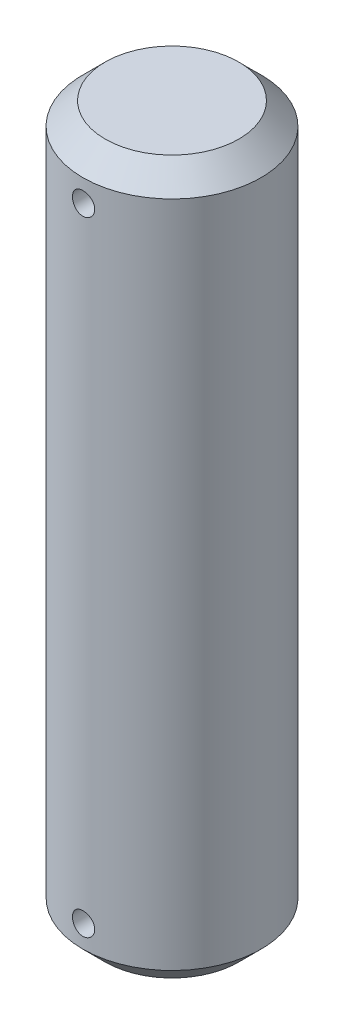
ISO-10303-21;
HEADER;
FILE_DESCRIPTION(('STEP AP214'),'2;1');
FILE_NAME('part.step','',(''),(''),'','','');
FILE_SCHEMA(('AUTOMOTIVE_DESIGN { 1 0 10303 214 1 1 1 1 }'));
ENDSEC;
DATA;
#1=APPLICATION_CONTEXT('core data for automotive mechanical design processes');
#2=APPLICATION_PROTOCOL_DEFINITION('international standard','automotive_design',2000,#1);
#3=PRODUCT_CONTEXT('',#1,'mechanical');
#4=PRODUCT('Part','Part','',(#3));
#5=PRODUCT_RELATED_PRODUCT_CATEGORY('part','',(#4));
#6=PRODUCT_DEFINITION_FORMATION('','',#4);
#7=PRODUCT_DEFINITION_CONTEXT('part definition',#1,'design');
#8=PRODUCT_DEFINITION('design','',#6,#7);
#9=PRODUCT_DEFINITION_SHAPE('','',#8);
#10=(LENGTH_UNIT() NAMED_UNIT(*) SI_UNIT(.MILLI.,.METRE.));
#11=(NAMED_UNIT(*) PLANE_ANGLE_UNIT() SI_UNIT($,.RADIAN.));
#12=(NAMED_UNIT(*) SI_UNIT($,.STERADIAN.) SOLID_ANGLE_UNIT());
#13=UNCERTAINTY_MEASURE_WITH_UNIT(LENGTH_MEASURE(1.E-05),#10,'distance_accuracy_value','');
#14=(GEOMETRIC_REPRESENTATION_CONTEXT(3) GLOBAL_UNCERTAINTY_ASSIGNED_CONTEXT((#13)) GLOBAL_UNIT_ASSIGNED_CONTEXT((#10,
#11,#12)) REPRESENTATION_CONTEXT('',''));
#15=CARTESIAN_POINT('',(0.,0.,0.));
#16=DIRECTION('',(0.,0.,1.));
#17=DIRECTION('',(1.,0.,0.));
#18=AXIS2_PLACEMENT_3D('',#15,#16,#17);
#19=CARTESIAN_POINT('',(0.,50.8,0.));
#20=DIRECTION('',(0.,-1.,0.));
#21=DIRECTION('',(0.,0.,-1.));
#22=AXIS2_PLACEMENT_3D('',#19,#20,#21);
#23=CYLINDRICAL_SURFACE('',#22,12.7);
#24=CARTESIAN_POINT('',(0.,-42.8625,-12.7));
#25=CARTESIAN_POINT('',(-0.0887990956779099,-42.8625037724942,-12.6999987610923));
#26=CARTESIAN_POINT('',(-0.177653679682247,-42.8699757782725,-12.6990588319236));
#27=CARTESIAN_POINT('',(-0.352890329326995,-42.8996651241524,-12.6953996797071));
#28=CARTESIAN_POINT('',(-0.439269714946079,-42.9218978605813,-12.6926785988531));
#29=CARTESIAN_POINT('',(-0.606993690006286,-42.9804434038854,-12.685763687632));
#30=CARTESIAN_POINT('',(-0.688341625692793,-43.0167467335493,-12.6815708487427));
#31=CARTESIAN_POINT('',(-0.843774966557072,-43.1023822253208,-12.6721787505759));
#32=CARTESIAN_POINT('',(-0.917861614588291,-43.151712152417,-12.6669796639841));
#33=CARTESIAN_POINT('',(-1.05709263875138,-43.2622908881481,-12.6561235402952));
#34=CARTESIAN_POINT('',(-1.12219128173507,-43.3235970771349,-12.6504643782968));
#35=CARTESIAN_POINT('',(-1.241204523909,-43.4562648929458,-12.6393430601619));
#36=CARTESIAN_POINT('',(-1.29511855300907,-43.5276270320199,-12.6338809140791));
#37=CARTESIAN_POINT('',(-1.39040245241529,-43.6786781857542,-12.6237511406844));
#38=CARTESIAN_POINT('',(-1.43172948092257,-43.7583944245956,-12.6190862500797));
#39=CARTESIAN_POINT('',(-1.50039265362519,-43.9237037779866,-12.6111071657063));
#40=CARTESIAN_POINT('',(-1.52772932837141,-44.0092966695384,-12.6077929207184));
#41=CARTESIAN_POINT('',(-1.56749685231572,-44.1834550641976,-12.6029106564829));
#42=CARTESIAN_POINT('',(-1.58000491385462,-44.2720026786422,-12.6013335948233));
#43=CARTESIAN_POINT('',(-1.58999907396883,-44.4499531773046,-12.6000765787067));
#44=CARTESIAN_POINT('',(-1.58748577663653,-44.5393560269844,-12.6003965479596));
#45=CARTESIAN_POINT('',(-1.56757194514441,-44.715941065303,-12.6028891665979));
#46=CARTESIAN_POINT('',(-1.55025646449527,-44.8031330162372,-12.6050512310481));
#47=CARTESIAN_POINT('',(-1.50136249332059,-44.9733638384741,-12.6109679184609));
#48=CARTESIAN_POINT('',(-1.46978371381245,-45.0564026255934,-12.6147225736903));
#49=CARTESIAN_POINT('',(-1.39316813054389,-45.2162341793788,-12.6234133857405));
#50=CARTESIAN_POINT('',(-1.34809436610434,-45.2930090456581,-12.6283527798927));
#51=CARTESIAN_POINT('',(-1.24579473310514,-45.4379372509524,-12.6388540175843));
#52=CARTESIAN_POINT('',(-1.18856830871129,-45.5060901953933,-12.644415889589));
#53=CARTESIAN_POINT('',(-1.06311643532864,-45.6323336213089,-12.6555824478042));
#54=CARTESIAN_POINT('',(-0.994817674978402,-45.6903512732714,-12.6611871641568));
#55=CARTESIAN_POINT('',(-0.849412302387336,-45.7941101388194,-12.6717719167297));
#56=CARTESIAN_POINT('',(-0.772305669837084,-45.8398513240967,-12.6767519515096));
#57=CARTESIAN_POINT('',(-0.611417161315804,-45.9177588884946,-12.685529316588));
#58=CARTESIAN_POINT('',(-0.527633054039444,-45.9499207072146,-12.6893262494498));
#59=CARTESIAN_POINT('',(-0.355795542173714,-45.9996987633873,-12.6953059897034));
#60=CARTESIAN_POINT('',(-0.267742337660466,-46.017315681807,-12.6974888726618));
#61=CARTESIAN_POINT('',(-0.0904958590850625,-46.0374094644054,-12.6999847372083));
#62=CARTESIAN_POINT('',(-0.00131412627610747,-46.0399866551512,-12.7003101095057));
#63=CARTESIAN_POINT('',(0.176209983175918,-46.0301925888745,-12.6990877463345));
#64=CARTESIAN_POINT('',(0.264552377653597,-46.0178216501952,-12.6975400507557));
#65=CARTESIAN_POINT('',(0.437594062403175,-45.9785658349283,-12.692753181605));
#66=CARTESIAN_POINT('',(0.522304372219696,-45.9517287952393,-12.6895195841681));
#67=CARTESIAN_POINT('',(0.686022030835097,-45.8843523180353,-12.6817229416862));
#68=CARTESIAN_POINT('',(0.765029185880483,-45.8438124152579,-12.677159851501));
#69=CARTESIAN_POINT('',(0.915545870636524,-45.7499382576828,-12.6671820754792));
#70=CARTESIAN_POINT('',(0.987014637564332,-45.6965391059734,-12.6617631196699));
#71=CARTESIAN_POINT('',(1.12001108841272,-45.5785540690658,-12.6506931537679));
#72=CARTESIAN_POINT('',(1.18153837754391,-45.5139677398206,-12.6450421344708));
#73=CARTESIAN_POINT('',(1.29326129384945,-45.3749997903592,-12.6341067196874));
#74=CARTESIAN_POINT('',(1.34339041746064,-45.3005645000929,-12.6288245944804));
#75=CARTESIAN_POINT('',(1.43043458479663,-45.1442720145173,-12.6192623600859));
#76=CARTESIAN_POINT('',(1.46734989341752,-45.0624149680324,-12.614982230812));
#77=CARTESIAN_POINT('',(1.52681087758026,-44.8938171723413,-12.6079240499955));
#78=CARTESIAN_POINT('',(1.54939404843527,-44.8070898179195,-12.6051420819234));
#79=CARTESIAN_POINT('',(1.57967044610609,-44.6310369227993,-12.6013839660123));
#80=CARTESIAN_POINT('',(1.58736436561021,-44.541711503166,-12.6004077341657));
#81=CARTESIAN_POINT('',(1.58763115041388,-44.363659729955,-12.6003740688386));
#82=CARTESIAN_POINT('',(1.58030849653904,-44.2749335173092,-12.6013033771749));
#83=CARTESIAN_POINT('',(1.55097124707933,-44.0999834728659,-12.6049475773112));
#84=CARTESIAN_POINT('',(1.52895664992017,-44.0137596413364,-12.6076624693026));
#85=CARTESIAN_POINT('',(1.47089309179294,-43.8462756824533,-12.6145678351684));
#86=CARTESIAN_POINT('',(1.43484916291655,-43.7650137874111,-12.6187577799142));
#87=CARTESIAN_POINT('',(1.34976038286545,-43.6096748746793,-12.6281420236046));
#88=CARTESIAN_POINT('',(1.30071536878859,-43.5355979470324,-12.6333363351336));
#89=CARTESIAN_POINT('',(1.19062902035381,-43.3961976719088,-12.6441873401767));
#90=CARTESIAN_POINT('',(1.1295098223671,-43.3309360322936,-12.6498468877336));
#91=CARTESIAN_POINT('',(0.997172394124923,-43.2115551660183,-12.6609654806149));
#92=CARTESIAN_POINT('',(0.925951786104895,-43.1574385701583,-12.66642447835));
#93=CARTESIAN_POINT('',(0.775122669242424,-43.0617087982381,-12.6765498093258));
#94=CARTESIAN_POINT('',(0.695483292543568,-43.020143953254,-12.6812130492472));
#95=CARTESIAN_POINT('',(0.530341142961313,-42.9510372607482,-12.6891900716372));
#96=CARTESIAN_POINT('',(0.4448448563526,-42.9234801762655,-12.6925053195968));
#97=CARTESIAN_POINT('',(0.299088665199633,-42.8897673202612,-12.6966136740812));
#98=CARTESIAN_POINT('',(0.239747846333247,-42.8795567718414,-12.6978773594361));
#99=CARTESIAN_POINT('',(0.120279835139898,-42.8659218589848,-12.6995709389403));
#100=CARTESIAN_POINT('',(0.0601526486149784,-42.8624974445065,-12.700000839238));
#101=CARTESIAN_POINT('',(0.,-42.8625,-12.7));
#102=B_SPLINE_CURVE_WITH_KNOTS('',3,(#24,#25,#26,#27,#28,#29,#30,#31,#32,#33,#34,#35,#36,#37,
#38,#39,#40,#41,#42,#43,#44,#45,#46,#47,#48,#49,#50,#51,#52,#53,#54,#55,#56,#57,#58,#59,#60,#61,
#62,#63,#64,#65,#66,#67,#68,#69,#70,#71,#72,#73,#74,#75,#76,#77,#78,#79,#80,#81,#82,#83,#84,#85,
#86,#87,#88,#89,#90,#91,#92,#93,#94,#95,#96,#97,#98,#99,#100,#101),.UNSPECIFIED.,.T.,.F.,(4,2,2,
2,2,2,2,2,2,2,2,2,2,2,2,2,2,2,2,2,2,2,2,2,2,2,2,2,2,2,2,2,2,2,2,2,2,2,4),(0.,0.266177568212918,
0.532633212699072,0.798909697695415,1.06514052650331,1.3326796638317,1.60023243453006,
1.86868593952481,2.13712926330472,2.40416858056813,2.67119715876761,2.93670162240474,
3.20221146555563,3.46845525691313,3.73471122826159,4.00280808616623,4.27090556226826,
4.53909300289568,4.807267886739,5.07365177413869,5.34002998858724,5.60553269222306,
5.87104441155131,6.13792525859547,6.4048167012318,6.67322751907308,6.94163295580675,
7.20933327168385,7.47702113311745,7.74285282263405,8.00868454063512,8.27442099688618,
8.54016078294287,8.80767375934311,9.07524981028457,9.34384340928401,9.6121442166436,
9.79245465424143,9.97276376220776),.UNSPECIFIED.);
#103=CARTESIAN_POINT('',(0.,-42.8625,-12.7));
#104=VERTEX_POINT('',#103);
#105=EDGE_CURVE('E35',#104,#104,#102,.T.);
#106=ORIENTED_EDGE('',*,*,#105,.T.);
#107=EDGE_LOOP('',(#106));
#108=FACE_BOUND('',#107,.T.);
#109=CARTESIAN_POINT('',(1.5875,-44.45,12.6003906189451));
#110=CARTESIAN_POINT('',(1.58749622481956,-44.5387960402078,12.6003918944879));
#111=CARTESIAN_POINT('',(1.58002471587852,-44.6276475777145,12.6013393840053));
#112=CARTESIAN_POINT('',(1.55033752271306,-44.8028778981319,12.6050255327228));
#113=CARTESIAN_POINT('',(1.52810643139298,-44.8892539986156,12.6077660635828));
#114=CARTESIAN_POINT('',(1.46956569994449,-45.0569710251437,12.614723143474));
#115=CARTESIAN_POINT('',(1.43326561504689,-45.1383153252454,12.6189386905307));
#116=CARTESIAN_POINT('',(1.34763776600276,-45.2937425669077,12.6283696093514));
#117=CARTESIAN_POINT('',(1.298312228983,-45.3678267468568,12.6335848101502));
#118=CARTESIAN_POINT('',(1.18773794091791,-45.5070605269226,12.6444601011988));
#119=CARTESIAN_POINT('',(1.12643082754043,-45.5721636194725,12.650122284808));
#120=CARTESIAN_POINT('',(0.993759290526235,-45.6911854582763,12.6612347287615));
#121=CARTESIAN_POINT('',(0.922394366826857,-45.7451036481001,12.6666849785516));
#122=CARTESIAN_POINT('',(0.771340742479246,-45.8403919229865,12.6767808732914));
#123=CARTESIAN_POINT('',(0.691625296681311,-45.8817199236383,12.6814237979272));
#124=CARTESIAN_POINT('',(0.52631766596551,-45.9503851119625,12.6893589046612));
#125=CARTESIAN_POINT('',(0.440725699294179,-45.9777228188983,12.6926511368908));
#126=CARTESIAN_POINT('',(0.266570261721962,-46.0174924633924,12.6974991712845));
#127=CARTESIAN_POINT('',(0.17802470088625,-46.0300017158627,12.6990639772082));
#128=CARTESIAN_POINT('',(7.82324359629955E-05,-46.0399989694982,12.7003115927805));
#129=CARTESIAN_POINT('',(-0.0893226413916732,-46.0374875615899,12.6999944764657));
#130=CARTESIAN_POINT('',(-0.26591594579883,-46.017576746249,12.6975212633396));
#131=CARTESIAN_POINT('',(-0.353117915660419,-46.0002604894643,12.6953754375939));
#132=CARTESIAN_POINT('',(-0.523368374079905,-45.95136150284,12.6894974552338));
#133=CARTESIAN_POINT('',(-0.606416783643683,-45.9197785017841,12.6857652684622));
#134=CARTESIAN_POINT('',(-0.766260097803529,-45.8431541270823,12.6771162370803));
#135=CARTESIAN_POINT('',(-0.843037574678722,-45.7980767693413,12.6721962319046));
#136=CARTESIAN_POINT('',(-0.987969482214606,-45.6957694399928,12.6617220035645));
#137=CARTESIAN_POINT('',(-1.05612351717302,-45.6385389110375,12.6561677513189));
#138=CARTESIAN_POINT('',(-1.18236239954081,-45.51308409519,12.6450018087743));
#139=CARTESIAN_POINT('',(-1.24037524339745,-45.4447873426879,12.63938998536));
#140=CARTESIAN_POINT('',(-1.34412536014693,-45.2993877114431,12.6287788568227));
#141=CARTESIAN_POINT('',(-1.38986259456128,-45.2222848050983,12.6237795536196));
#142=CARTESIAN_POINT('',(-1.46776730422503,-45.0613973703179,12.6149595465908));
#143=CARTESIAN_POINT('',(-1.49992901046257,-44.9776100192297,12.6111393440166));
#144=CARTESIAN_POINT('',(-1.54970585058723,-44.8057654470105,12.6051198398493));
#145=CARTESIAN_POINT('',(-1.56732168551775,-44.717708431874,12.6029204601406));
#146=CARTESIAN_POINT('',(-1.58741137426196,-44.5404600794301,12.6004058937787));
#147=CARTESIAN_POINT('',(-1.58998655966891,-44.4512803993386,12.6000780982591));
#148=CARTESIAN_POINT('',(-1.5801892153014,-44.2737608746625,12.6013104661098));
#149=CARTESIAN_POINT('',(-1.56781700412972,-44.1854210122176,12.6028705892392));
#150=CARTESIAN_POINT('',(-1.52856138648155,-44.0123924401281,12.6076915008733));
#151=CARTESIAN_POINT('',(-1.50172704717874,-43.9276924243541,12.6109465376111));
#152=CARTESIAN_POINT('',(-1.43435941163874,-43.7639941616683,12.6187858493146));
#153=CARTESIAN_POINT('',(-1.39382563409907,-43.684996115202,12.6233701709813));
#154=CARTESIAN_POINT('',(-1.29996058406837,-43.5344858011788,12.633381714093));
#155=CARTESIAN_POINT('',(-1.24656286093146,-43.4630152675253,12.6388132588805));
#156=CARTESIAN_POINT('',(-1.12857962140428,-43.3300145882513,12.649893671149));
#157=CARTESIAN_POINT('',(-1.06399366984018,-43.2684848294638,12.6555425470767));
#158=CARTESIAN_POINT('',(-0.925024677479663,-43.1567563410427,12.6664598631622));
#159=CARTESIAN_POINT('',(-0.850587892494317,-43.1066241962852,12.6717259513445));
#160=CARTESIAN_POINT('',(-0.694291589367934,-43.0195747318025,12.6812491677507));
#161=CARTESIAN_POINT('',(-0.612432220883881,-42.9826571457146,12.685506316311));
#162=CARTESIAN_POINT('',(-0.44383570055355,-42.9231947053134,12.6925215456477));
#163=CARTESIAN_POINT('',(-0.357112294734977,-42.9006113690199,12.6952836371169));
#164=CARTESIAN_POINT('',(-0.181067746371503,-42.870333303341,12.6990141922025));
#165=CARTESIAN_POINT('',(-0.0917467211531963,-42.8626379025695,12.6999827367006));
#166=CARTESIAN_POINT('',(0.0863074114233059,-42.8623666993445,12.7000166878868));
#167=CARTESIAN_POINT('',(0.17504037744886,-42.8696882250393,12.6990950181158));
#168=CARTESIAN_POINT('',(0.350004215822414,-42.8990255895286,12.6954777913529));
#169=CARTESIAN_POINT('',(0.436235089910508,-42.9210414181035,12.6927822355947));
#170=CARTESIAN_POINT('',(0.60373351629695,-42.9791102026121,12.6859187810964));
#171=CARTESIAN_POINT('',(0.685002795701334,-43.015158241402,12.6817513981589));
#172=CARTESIAN_POINT('',(0.840354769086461,-43.1002575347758,12.6724057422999));
#173=CARTESIAN_POINT('',(0.914437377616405,-43.1493089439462,12.6672274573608));
#174=CARTESIAN_POINT('',(1.05383759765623,-43.2594024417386,12.6563957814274));
#175=CARTESIAN_POINT('',(1.11909465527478,-43.3205209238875,12.6507395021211));
#176=CARTESIAN_POINT('',(1.23846661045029,-43.4528550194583,12.639612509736));
#177=CARTESIAN_POINT('',(1.29257886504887,-43.5240730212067,12.6341418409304));
#178=CARTESIAN_POINT('',(1.38830382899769,-43.6748999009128,12.6239829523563));
#179=CARTESIAN_POINT('',(1.42986746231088,-43.7545401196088,12.619297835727));
#180=CARTESIAN_POINT('',(1.49897165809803,-43.9196840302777,12.6112768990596));
#181=CARTESIAN_POINT('',(1.52652747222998,-44.0051812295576,12.6079396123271));
#182=CARTESIAN_POINT('',(1.56023684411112,-44.1509340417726,12.603802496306));
#183=CARTESIAN_POINT('',(1.57044582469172,-44.2102703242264,12.6025294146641));
#184=CARTESIAN_POINT('',(1.5840786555,-44.329729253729,12.6008230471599));
#185=CARTESIAN_POINT('',(1.58750255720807,-44.3898518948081,12.6003897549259));
#186=CARTESIAN_POINT('',(1.5875,-44.45,12.6003906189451));
#187=B_SPLINE_CURVE_WITH_KNOTS('',3,(#109,#110,#111,#112,#113,#114,#115,#116,#117,#118,#119,
#120,#121,#122,#123,#124,#125,#126,#127,#128,#129,#130,#131,#132,#133,#134,#135,#136,#137,#138,
#139,#140,#141,#142,#143,#144,#145,#146,#147,#148,#149,#150,#151,#152,#153,#154,#155,#156,#157,
#158,#159,#160,#161,#162,#163,#164,#165,#166,#167,#168,#169,#170,#171,#172,#173,#174,#175,#176,
#177,#178,#179,#180,#181,#182,#183,#184,#185,#186),.UNSPECIFIED.,.T.,.F.,(4,2,2,2,2,2,2,2,2,2,2,
2,2,2,2,2,2,2,2,2,2,2,2,2,2,2,2,2,2,2,2,2,2,2,2,2,2,2,4),(0.,0.266168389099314,
0.532615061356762,0.798881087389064,1.06510161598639,1.33265276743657,1.60021722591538,
1.86866648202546,2.13710577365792,2.40413919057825,2.67116210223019,2.93669507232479,
3.20223309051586,3.4684855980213,3.73475031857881,4.00283487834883,4.27092027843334,
4.53911948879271,4.80730577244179,5.07368313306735,5.34005481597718,5.60552838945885,
5.87101129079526,6.1378961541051,6.40479140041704,6.67320792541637,6.94161903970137,
7.20930649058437,7.47698186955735,7.74283323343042,8.0086844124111,8.27444251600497,
8.54020377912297,8.8077048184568,9.07526922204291,9.34386687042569,9.6121714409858,
9.79246828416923,9.97276375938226),.UNSPECIFIED.);
#188=CARTESIAN_POINT('',(1.5875,-44.45,12.6003906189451));
#189=VERTEX_POINT('',#188);
#190=EDGE_CURVE('E91',#189,#189,#187,.T.);
#191=ORIENTED_EDGE('',*,*,#190,.T.);
#192=EDGE_LOOP('',(#191));
#193=FACE_BOUND('',#192,.T.);
#194=CARTESIAN_POINT('',(0.,46.0375,-12.7));
#195=CARTESIAN_POINT('',(-0.0887990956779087,46.0374962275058,-12.6999987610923));
#196=CARTESIAN_POINT('',(-0.177653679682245,46.0300242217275,-12.6990588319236));
#197=CARTESIAN_POINT('',(-0.352890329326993,46.0003348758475,-12.6953996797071));
#198=CARTESIAN_POINT('',(-0.439269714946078,45.9781021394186,-12.6926785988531));
#199=CARTESIAN_POINT('',(-0.60699369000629,45.9195565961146,-12.685763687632));
#200=CARTESIAN_POINT('',(-0.688341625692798,45.8832532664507,-12.6815708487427));
#201=CARTESIAN_POINT('',(-0.843774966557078,45.7976177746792,-12.6721787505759));
#202=CARTESIAN_POINT('',(-0.917861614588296,45.748287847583,-12.6669796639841));
#203=CARTESIAN_POINT('',(-1.05709263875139,45.6377091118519,-12.6561235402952));
#204=CARTESIAN_POINT('',(-1.12219128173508,45.5764029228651,-12.6504643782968));
#205=CARTESIAN_POINT('',(-1.24120452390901,45.4437351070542,-12.6393430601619));
#206=CARTESIAN_POINT('',(-1.29511855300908,45.3723729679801,-12.6338809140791));
#207=CARTESIAN_POINT('',(-1.3904024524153,45.2213218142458,-12.6237511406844));
#208=CARTESIAN_POINT('',(-1.43172948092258,45.1416055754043,-12.6190862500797));
#209=CARTESIAN_POINT('',(-1.5003926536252,44.9762962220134,-12.6111071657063));
#210=CARTESIAN_POINT('',(-1.52772932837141,44.8907033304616,-12.6077929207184));
#211=CARTESIAN_POINT('',(-1.56749685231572,44.7165449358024,-12.6029106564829));
#212=CARTESIAN_POINT('',(-1.58000491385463,44.6279973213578,-12.6013335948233));
#213=CARTESIAN_POINT('',(-1.58999907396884,44.4500468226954,-12.6000765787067));
#214=CARTESIAN_POINT('',(-1.58748577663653,44.3606439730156,-12.6003965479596));
#215=CARTESIAN_POINT('',(-1.56757194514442,44.184058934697,-12.6028891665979));
#216=CARTESIAN_POINT('',(-1.55025646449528,44.0968669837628,-12.6050512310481));
#217=CARTESIAN_POINT('',(-1.5013624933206,43.9266361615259,-12.6109679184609));
#218=CARTESIAN_POINT('',(-1.46978371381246,43.8435973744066,-12.6147225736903));
#219=CARTESIAN_POINT('',(-1.39316813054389,43.6837658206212,-12.6234133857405));
#220=CARTESIAN_POINT('',(-1.34809436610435,43.6069909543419,-12.6283527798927));
#221=CARTESIAN_POINT('',(-1.24579473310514,43.4620627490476,-12.6388540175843));
#222=CARTESIAN_POINT('',(-1.18856830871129,43.3939098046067,-12.644415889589));
#223=CARTESIAN_POINT('',(-1.06311643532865,43.2676663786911,-12.6555824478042));
#224=CARTESIAN_POINT('',(-0.994817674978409,43.2096487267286,-12.6611871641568));
#225=CARTESIAN_POINT('',(-0.849412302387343,43.1058898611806,-12.6717719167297));
#226=CARTESIAN_POINT('',(-0.772305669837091,43.0601486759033,-12.6767519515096));
#227=CARTESIAN_POINT('',(-0.611417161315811,42.9822411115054,-12.685529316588));
#228=CARTESIAN_POINT('',(-0.527633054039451,42.9500792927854,-12.6893262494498));
#229=CARTESIAN_POINT('',(-0.355795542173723,42.9003012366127,-12.6953059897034));
#230=CARTESIAN_POINT('',(-0.267742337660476,42.882684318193,-12.6974888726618));
#231=CARTESIAN_POINT('',(-0.0904958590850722,42.8625905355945,-12.6999847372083));
#232=CARTESIAN_POINT('',(-0.00131412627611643,42.8600133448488,-12.7003101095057));
#233=CARTESIAN_POINT('',(0.17620998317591,42.8698074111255,-12.6990877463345));
#234=CARTESIAN_POINT('',(0.264552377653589,42.8821783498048,-12.6975400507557));
#235=CARTESIAN_POINT('',(0.437594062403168,42.9214341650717,-12.692753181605));
#236=CARTESIAN_POINT('',(0.522304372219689,42.9482712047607,-12.6895195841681));
#237=CARTESIAN_POINT('',(0.68602203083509,43.0156476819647,-12.6817229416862));
#238=CARTESIAN_POINT('',(0.765029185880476,43.0561875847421,-12.677159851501));
#239=CARTESIAN_POINT('',(0.915545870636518,43.1500617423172,-12.6671820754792));
#240=CARTESIAN_POINT('',(0.987014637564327,43.2034608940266,-12.6617631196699));
#241=CARTESIAN_POINT('',(1.12001108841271,43.3214459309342,-12.6506931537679));
#242=CARTESIAN_POINT('',(1.1815383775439,43.3860322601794,-12.6450421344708));
#243=CARTESIAN_POINT('',(1.29326129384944,43.5250002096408,-12.6341067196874));
#244=CARTESIAN_POINT('',(1.34339041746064,43.5994354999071,-12.6288245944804));
#245=CARTESIAN_POINT('',(1.43043458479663,43.7557279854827,-12.6192623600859));
#246=CARTESIAN_POINT('',(1.46734989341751,43.8375850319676,-12.614982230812));
#247=CARTESIAN_POINT('',(1.52681087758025,44.0061828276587,-12.6079240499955));
#248=CARTESIAN_POINT('',(1.54939404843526,44.0929101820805,-12.6051420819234));
#249=CARTESIAN_POINT('',(1.57967044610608,44.2689630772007,-12.6013839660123));
#250=CARTESIAN_POINT('',(1.58736436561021,44.358288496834,-12.6004077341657));
#251=CARTESIAN_POINT('',(1.58763115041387,44.536340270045,-12.6003740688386));
#252=CARTESIAN_POINT('',(1.58030849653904,44.6250664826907,-12.6013033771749));
#253=CARTESIAN_POINT('',(1.55097124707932,44.8000165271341,-12.6049475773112));
#254=CARTESIAN_POINT('',(1.52895664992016,44.8862403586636,-12.6076624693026));
#255=CARTESIAN_POINT('',(1.47089309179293,45.0537243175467,-12.6145678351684));
#256=CARTESIAN_POINT('',(1.43484916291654,45.1349862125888,-12.6187577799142));
#257=CARTESIAN_POINT('',(1.34976038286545,45.2903251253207,-12.6281420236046));
#258=CARTESIAN_POINT('',(1.30071536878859,45.3644020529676,-12.6333363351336));
#259=CARTESIAN_POINT('',(1.19062902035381,45.5038023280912,-12.6441873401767));
#260=CARTESIAN_POINT('',(1.1295098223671,45.5690639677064,-12.6498468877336));
#261=CARTESIAN_POINT('',(0.997172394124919,45.6884448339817,-12.6609654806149));
#262=CARTESIAN_POINT('',(0.925951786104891,45.7425614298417,-12.66642447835));
#263=CARTESIAN_POINT('',(0.775122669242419,45.8382912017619,-12.6765498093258));
#264=CARTESIAN_POINT('',(0.695483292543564,45.879856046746,-12.6812130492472));
#265=CARTESIAN_POINT('',(0.530341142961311,45.9489627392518,-12.6891900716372));
#266=CARTESIAN_POINT('',(0.444844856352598,45.9765198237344,-12.6925053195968));
#267=CARTESIAN_POINT('',(0.299088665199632,46.0102326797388,-12.6966136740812));
#268=CARTESIAN_POINT('',(0.239747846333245,46.0204432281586,-12.6978773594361));
#269=CARTESIAN_POINT('',(0.120279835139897,46.0340781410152,-12.6995709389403));
#270=CARTESIAN_POINT('',(0.0601526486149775,46.0375025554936,-12.700000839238));
#271=CARTESIAN_POINT('',(0.,46.0375,-12.7));
#272=B_SPLINE_CURVE_WITH_KNOTS('',3,(#194,#195,#196,#197,#198,#199,#200,#201,#202,#203,#204,
#205,#206,#207,#208,#209,#210,#211,#212,#213,#214,#215,#216,#217,#218,#219,#220,#221,#222,#223,
#224,#225,#226,#227,#228,#229,#230,#231,#232,#233,#234,#235,#236,#237,#238,#239,#240,#241,#242,
#243,#244,#245,#246,#247,#248,#249,#250,#251,#252,#253,#254,#255,#256,#257,#258,#259,#260,#261,
#262,#263,#264,#265,#266,#267,#268,#269,#270,#271),.UNSPECIFIED.,.T.,.F.,(4,2,2,2,2,2,2,2,2,2,2,
2,2,2,2,2,2,2,2,2,2,2,2,2,2,2,2,2,2,2,2,2,2,2,2,2,2,2,4),(0.,0.266177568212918,
0.532633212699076,0.798909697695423,1.06514052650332,1.33267966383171,1.60023243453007,
1.86868593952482,2.13712926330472,2.40416858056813,2.67119715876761,2.93670162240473,
3.20221146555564,3.46845525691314,3.7347112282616,4.00280808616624,4.27090556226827,
4.53909300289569,4.807267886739,5.0736517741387,5.34002998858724,5.60553269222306,
5.87104441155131,6.13792525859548,6.4048167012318,6.67322751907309,6.94163295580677,
7.20933327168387,7.47702113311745,7.74285282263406,8.00868454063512,8.27442099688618,
8.54016078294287,8.80767375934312,9.07524981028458,9.34384340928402,9.61214421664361,
9.79245465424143,9.97276376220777),.UNSPECIFIED.);
#273=CARTESIAN_POINT('',(0.,46.0375,-12.7));
#274=VERTEX_POINT('',#273);
#275=EDGE_CURVE('E58',#274,#274,#272,.T.);
#276=ORIENTED_EDGE('',*,*,#275,.T.);
#277=EDGE_LOOP('',(#276));
#278=FACE_BOUND('',#277,.T.);
#279=CARTESIAN_POINT('',(1.5875,44.45,12.6003906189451));
#280=CARTESIAN_POINT('',(1.58749622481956,44.3612039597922,12.6003918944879));
#281=CARTESIAN_POINT('',(1.58002471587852,44.2723524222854,12.6013393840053));
#282=CARTESIAN_POINT('',(1.55033752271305,44.0971221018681,12.6050255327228));
#283=CARTESIAN_POINT('',(1.52810643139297,44.0107460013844,12.6077660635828));
#284=CARTESIAN_POINT('',(1.46956569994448,43.8430289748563,12.614723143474));
#285=CARTESIAN_POINT('',(1.43326561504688,43.7616846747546,12.6189386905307));
#286=CARTESIAN_POINT('',(1.34763776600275,43.6062574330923,12.6283696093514));
#287=CARTESIAN_POINT('',(1.29831222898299,43.5321732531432,12.6335848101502));
#288=CARTESIAN_POINT('',(1.1877379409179,43.3929394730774,12.6444601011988));
#289=CARTESIAN_POINT('',(1.12643082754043,43.3278363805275,12.650122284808));
#290=CARTESIAN_POINT('',(0.99375929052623,43.2088145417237,12.6612347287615));
#291=CARTESIAN_POINT('',(0.922394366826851,43.1548963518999,12.6666849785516));
#292=CARTESIAN_POINT('',(0.771340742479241,43.0596080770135,12.6767808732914));
#293=CARTESIAN_POINT('',(0.691625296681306,43.0182800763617,12.6814237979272));
#294=CARTESIAN_POINT('',(0.526317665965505,42.9496148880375,12.6893589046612));
#295=CARTESIAN_POINT('',(0.440725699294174,42.9222771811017,12.6926511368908));
#296=CARTESIAN_POINT('',(0.266570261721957,42.8825075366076,12.6974991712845));
#297=CARTESIAN_POINT('',(0.178024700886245,42.8699982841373,12.6990639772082));
#298=CARTESIAN_POINT('',(7.82324359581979E-05,42.8600010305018,12.7003115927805));
#299=CARTESIAN_POINT('',(-0.089322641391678,42.8625124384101,12.6999944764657));
#300=CARTESIAN_POINT('',(-0.265915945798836,42.882423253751,12.6975212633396));
#301=CARTESIAN_POINT('',(-0.353117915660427,42.8997395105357,12.6953754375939));
#302=CARTESIAN_POINT('',(-0.523368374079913,42.94863849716,12.6894974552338));
#303=CARTESIAN_POINT('',(-0.606416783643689,42.9802214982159,12.6857652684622));
#304=CARTESIAN_POINT('',(-0.766260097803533,43.0568458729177,12.6771162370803));
#305=CARTESIAN_POINT('',(-0.843037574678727,43.1019232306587,12.6721962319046));
#306=CARTESIAN_POINT('',(-0.987969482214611,43.2042305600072,12.6617220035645));
#307=CARTESIAN_POINT('',(-1.05612351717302,43.2614610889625,12.6561677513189));
#308=CARTESIAN_POINT('',(-1.18236239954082,43.38691590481,12.6450018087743));
#309=CARTESIAN_POINT('',(-1.24037524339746,43.4552126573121,12.63938998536));
#310=CARTESIAN_POINT('',(-1.34412536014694,43.6006122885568,12.6287788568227));
#311=CARTESIAN_POINT('',(-1.38986259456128,43.6777151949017,12.6237795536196));
#312=CARTESIAN_POINT('',(-1.46776730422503,43.8386026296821,12.6149595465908));
#313=CARTESIAN_POINT('',(-1.49992901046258,43.9223899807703,12.6111393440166));
#314=CARTESIAN_POINT('',(-1.54970585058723,44.0942345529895,12.6051198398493));
#315=CARTESIAN_POINT('',(-1.56732168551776,44.182291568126,12.6029204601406));
#316=CARTESIAN_POINT('',(-1.58741137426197,44.3595399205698,12.6004058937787));
#317=CARTESIAN_POINT('',(-1.58998655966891,44.4487196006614,12.6000780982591));
#318=CARTESIAN_POINT('',(-1.5801892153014,44.6262391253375,12.6013104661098));
#319=CARTESIAN_POINT('',(-1.56781700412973,44.7145789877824,12.6028705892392));
#320=CARTESIAN_POINT('',(-1.52856138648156,44.8876075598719,12.6076915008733));
#321=CARTESIAN_POINT('',(-1.50172704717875,44.9723075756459,12.6109465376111));
#322=CARTESIAN_POINT('',(-1.43435941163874,45.1360058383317,12.6187858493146));
#323=CARTESIAN_POINT('',(-1.39382563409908,45.2150038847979,12.6233701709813));
#324=CARTESIAN_POINT('',(-1.29996058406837,45.3655141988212,12.633381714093));
#325=CARTESIAN_POINT('',(-1.24656286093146,45.4369847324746,12.6388132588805));
#326=CARTESIAN_POINT('',(-1.12857962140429,45.5699854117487,12.649893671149));
#327=CARTESIAN_POINT('',(-1.06399366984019,45.6315151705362,12.6555425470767));
#328=CARTESIAN_POINT('',(-0.925024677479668,45.7432436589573,12.6664598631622));
#329=CARTESIAN_POINT('',(-0.850587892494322,45.7933758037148,12.6717259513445));
#330=CARTESIAN_POINT('',(-0.69429158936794,45.8804252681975,12.6812491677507));
#331=CARTESIAN_POINT('',(-0.612432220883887,45.9173428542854,12.685506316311));
#332=CARTESIAN_POINT('',(-0.443835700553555,45.9768052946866,12.6925215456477));
#333=CARTESIAN_POINT('',(-0.357112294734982,45.9993886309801,12.6952836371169));
#334=CARTESIAN_POINT('',(-0.181067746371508,46.029666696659,12.6990141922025));
#335=CARTESIAN_POINT('',(-0.0917467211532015,46.0373620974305,12.6999827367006));
#336=CARTESIAN_POINT('',(0.0863074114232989,46.0376333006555,12.7000166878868));
#337=CARTESIAN_POINT('',(0.175040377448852,46.0303117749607,12.6990950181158));
#338=CARTESIAN_POINT('',(0.350004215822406,46.0009744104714,12.6954777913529));
#339=CARTESIAN_POINT('',(0.436235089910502,45.9789585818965,12.6927822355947));
#340=CARTESIAN_POINT('',(0.603733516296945,45.9208897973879,12.6859187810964));
#341=CARTESIAN_POINT('',(0.685002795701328,45.884841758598,12.6817513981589));
#342=CARTESIAN_POINT('',(0.840354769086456,45.7997424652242,12.6724057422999));
#343=CARTESIAN_POINT('',(0.9144373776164,45.7506910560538,12.6672274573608));
#344=CARTESIAN_POINT('',(1.05383759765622,45.6405975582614,12.6563957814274));
#345=CARTESIAN_POINT('',(1.11909465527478,45.5794790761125,12.6507395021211));
#346=CARTESIAN_POINT('',(1.23846661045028,45.4471449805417,12.639612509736));
#347=CARTESIAN_POINT('',(1.29257886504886,45.3759269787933,12.6341418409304));
#348=CARTESIAN_POINT('',(1.38830382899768,45.2251000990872,12.6239829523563));
#349=CARTESIAN_POINT('',(1.42986746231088,45.1454598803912,12.619297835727));
#350=CARTESIAN_POINT('',(1.49897165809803,44.9803159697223,12.6112768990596));
#351=CARTESIAN_POINT('',(1.52652747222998,44.8948187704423,12.6079396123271));
#352=CARTESIAN_POINT('',(1.56023684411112,44.7490659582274,12.603802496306));
#353=CARTESIAN_POINT('',(1.57044582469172,44.6897296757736,12.6025294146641));
#354=CARTESIAN_POINT('',(1.5840786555,44.570270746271,12.6008230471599));
#355=CARTESIAN_POINT('',(1.58750255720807,44.5101481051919,12.6003897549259));
#356=CARTESIAN_POINT('',(1.5875,44.45,12.6003906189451));
#357=B_SPLINE_CURVE_WITH_KNOTS('',3,(#279,#280,#281,#282,#283,#284,#285,#286,#287,#288,#289,
#290,#291,#292,#293,#294,#295,#296,#297,#298,#299,#300,#301,#302,#303,#304,#305,#306,#307,#308,
#309,#310,#311,#312,#313,#314,#315,#316,#317,#318,#319,#320,#321,#322,#323,#324,#325,#326,#327,
#328,#329,#330,#331,#332,#333,#334,#335,#336,#337,#338,#339,#340,#341,#342,#343,#344,#345,#346,
#347,#348,#349,#350,#351,#352,#353,#354,#355,#356),.UNSPECIFIED.,.T.,.F.,(4,2,2,2,2,2,2,2,2,2,2,
2,2,2,2,2,2,2,2,2,2,2,2,2,2,2,2,2,2,2,2,2,2,2,2,2,2,2,4),(0.,0.266168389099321,
0.532615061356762,0.798881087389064,1.06510161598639,1.33265276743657,1.60021722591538,
1.86866648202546,2.13710577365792,2.40413919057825,2.67116210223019,2.93669507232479,
3.20223309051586,3.4684855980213,3.73475031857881,4.00283487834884,4.27092027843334,
4.53911948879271,4.80730577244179,5.07368313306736,5.34005481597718,5.60552838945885,
5.87101129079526,6.1378961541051,6.40479140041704,6.67320792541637,6.94161903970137,
7.20930649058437,7.47698186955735,7.74283323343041,8.0086844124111,8.27444251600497,
8.54020377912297,8.80770481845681,9.07526922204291,9.3438668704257,9.6121714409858,
9.79246828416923,9.97276375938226),.UNSPECIFIED.);
#358=CARTESIAN_POINT('',(1.5875,44.45,12.6003906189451));
#359=VERTEX_POINT('',#358);
#360=EDGE_CURVE('E52',#359,#359,#357,.T.);
#361=ORIENTED_EDGE('',*,*,#360,.T.);
#362=EDGE_LOOP('',(#361));
#363=FACE_BOUND('',#362,.T.);
#364=CARTESIAN_POINT('',(0.,47.625,0.));
#365=DIRECTION('',(0.,1.,0.));
#366=DIRECTION('',(0.,0.,1.));
#367=AXIS2_PLACEMENT_3D('',#364,#365,#366);
#368=CIRCLE('',#367,12.7);
#369=CARTESIAN_POINT('',(0.,47.625,12.7));
#370=VERTEX_POINT('',#369);
#371=EDGE_CURVE('E43',#370,#370,#368,.F.);
#372=ORIENTED_EDGE('',*,*,#371,.T.);
#373=EDGE_LOOP('',(#372));
#374=FACE_BOUND('',#373,.T.);
#375=CARTESIAN_POINT('',(0.,-47.625,0.));
#376=DIRECTION('',(0.,1.,0.));
#377=DIRECTION('',(0.,0.,1.));
#378=AXIS2_PLACEMENT_3D('',#375,#376,#377);
#379=CIRCLE('',#378,12.7);
#380=CARTESIAN_POINT('',(0.,-47.625,12.7));
#381=VERTEX_POINT('',#380);
#382=EDGE_CURVE('E48',#381,#381,#379,.T.);
#383=ORIENTED_EDGE('',*,*,#382,.T.);
#384=EDGE_LOOP('',(#383));
#385=FACE_BOUND('',#384,.T.);
#386=ADVANCED_FACE('F31',(#108,#193,#278,#363,#374,#385),#23,.T.);
#387=CARTESIAN_POINT('',(0.,50.8,0.));
#388=DIRECTION('',(0.,1.,0.));
#389=DIRECTION('',(0.,0.,1.));
#390=AXIS2_PLACEMENT_3D('',#387,#388,#389);
#391=PLANE('',#390);
#392=CARTESIAN_POINT('',(0.,50.8,0.));
#393=DIRECTION('',(0.,1.,0.));
#394=DIRECTION('',(0.,0.,1.));
#395=AXIS2_PLACEMENT_3D('',#392,#393,#394);
#396=CIRCLE('',#395,9.52500000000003);
#397=CARTESIAN_POINT('',(0.,50.8,9.52500000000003));
#398=VERTEX_POINT('',#397);
#399=EDGE_CURVE('E102',#398,#398,#396,.T.);
#400=ORIENTED_EDGE('',*,*,#399,.T.);
#401=EDGE_LOOP('',(#400));
#402=FACE_BOUND('',#401,.T.);
#403=ADVANCED_FACE('F70',(#402),#391,.T.);
#404=CARTESIAN_POINT('',(0.,-50.8,0.));
#405=DIRECTION('',(0.,1.,0.));
#406=DIRECTION('',(0.,0.,1.));
#407=AXIS2_PLACEMENT_3D('',#404,#405,#406);
#408=PLANE('',#407);
#409=CARTESIAN_POINT('',(0.,-50.8,0.));
#410=DIRECTION('',(0.,1.,0.));
#411=DIRECTION('',(0.,0.,1.));
#412=AXIS2_PLACEMENT_3D('',#409,#410,#411);
#413=CIRCLE('',#412,9.52499999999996);
#414=CARTESIAN_POINT('',(0.,-50.8,9.52499999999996));
#415=VERTEX_POINT('',#414);
#416=EDGE_CURVE('E10',#415,#415,#413,.F.);
#417=ORIENTED_EDGE('',*,*,#416,.T.);
#418=EDGE_LOOP('',(#417));
#419=FACE_BOUND('',#418,.T.);
#420=ADVANCED_FACE('F73',(#419),#408,.F.);
#421=CARTESIAN_POINT('',(0.,50.8,0.));
#422=DIRECTION('',(0.,-1.,0.));
#423=DIRECTION('',(0.,0.,-1.));
#424=AXIS2_PLACEMENT_3D('',#421,#422,#423);
#425=CONICAL_SURFACE('',#424,9.52500000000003,0.785398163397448);
#426=ORIENTED_EDGE('',*,*,#371,.F.);
#427=EDGE_LOOP('',(#426));
#428=FACE_BOUND('',#427,.T.);
#429=ORIENTED_EDGE('',*,*,#399,.F.);
#430=EDGE_LOOP('',(#429));
#431=FACE_BOUND('',#430,.T.);
#432=ADVANCED_FACE('F76',(#428,#431),#425,.T.);
#433=CARTESIAN_POINT('',(0.,-47.625,0.));
#434=DIRECTION('',(0.,1.,0.));
#435=DIRECTION('',(0.,0.,1.));
#436=AXIS2_PLACEMENT_3D('',#433,#434,#435);
#437=CONICAL_SURFACE('',#436,12.7,0.785398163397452);
#438=CARTESIAN_POINT('',(0.,-50.8,9.52499999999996));
#439=CARTESIAN_POINT('',(0.,-50.7669270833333,9.55807291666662));
#440=CARTESIAN_POINT('',(0.,-50.7338541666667,9.59114583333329));
#441=CARTESIAN_POINT('',(0.,-50.6677083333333,9.65729166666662));
#442=CARTESIAN_POINT('',(0.,-50.6346354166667,9.69036458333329));
#443=CARTESIAN_POINT('',(0.,-50.5684895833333,9.75651041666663));
#444=CARTESIAN_POINT('',(0.,-50.5354166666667,9.78958333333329));
#445=CARTESIAN_POINT('',(0.,-50.4692708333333,9.85572916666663));
#446=CARTESIAN_POINT('',(0.,-50.4361979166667,9.88880208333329));
#447=CARTESIAN_POINT('',(0.,-50.3700520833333,9.95494791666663));
#448=CARTESIAN_POINT('',(0.,-50.3369791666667,9.9880208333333));
#449=CARTESIAN_POINT('',(0.,-50.2708333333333,10.0541666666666));
#450=CARTESIAN_POINT('',(0.,-50.2377604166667,10.0872395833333));
#451=CARTESIAN_POINT('',(0.,-50.1716145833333,10.1533854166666));
#452=CARTESIAN_POINT('',(0.,-50.1385416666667,10.1864583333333));
#453=CARTESIAN_POINT('',(0.,-50.0723958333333,10.2526041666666));
#454=CARTESIAN_POINT('',(0.,-50.0393229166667,10.2856770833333));
#455=CARTESIAN_POINT('',(0.,-49.9731770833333,10.3518229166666));
#456=CARTESIAN_POINT('',(0.,-49.9401041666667,10.3848958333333));
#457=CARTESIAN_POINT('',(0.,-49.8739583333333,10.4510416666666));
#458=CARTESIAN_POINT('',(0.,-49.8408854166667,10.4841145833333));
#459=CARTESIAN_POINT('',(0.,-49.7747395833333,10.5502604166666));
#460=CARTESIAN_POINT('',(0.,-49.7416666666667,10.5833333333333));
#461=CARTESIAN_POINT('',(0.,-49.6755208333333,10.6494791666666));
#462=CARTESIAN_POINT('',(0.,-49.6424479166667,10.6825520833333));
#463=CARTESIAN_POINT('',(0.,-49.5763020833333,10.7486979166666));
#464=CARTESIAN_POINT('',(0.,-49.5432291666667,10.7817708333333));
#465=CARTESIAN_POINT('',(0.,-49.4770833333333,10.8479166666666));
#466=CARTESIAN_POINT('',(0.,-49.4440104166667,10.8809895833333));
#467=CARTESIAN_POINT('',(0.,-49.3778645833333,10.9471354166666));
#468=CARTESIAN_POINT('',(0.,-49.3447916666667,10.9802083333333));
#469=CARTESIAN_POINT('',(0.,-49.2786458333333,11.0463541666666));
#470=CARTESIAN_POINT('',(0.,-49.2455729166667,11.0794270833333));
#471=CARTESIAN_POINT('',(0.,-49.1794270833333,11.1455729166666));
#472=CARTESIAN_POINT('',(0.,-49.1463541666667,11.1786458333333));
#473=CARTESIAN_POINT('',(0.,-49.0802083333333,11.2447916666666));
#474=CARTESIAN_POINT('',(0.,-49.0471354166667,11.2778645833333));
#475=CARTESIAN_POINT('',(0.,-48.9809895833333,11.3440104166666));
#476=CARTESIAN_POINT('',(0.,-48.9479166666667,11.3770833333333));
#477=CARTESIAN_POINT('',(0.,-48.8817708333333,11.4432291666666));
#478=CARTESIAN_POINT('',(0.,-48.8486979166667,11.4763020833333));
#479=CARTESIAN_POINT('',(0.,-48.7825520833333,11.5424479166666));
#480=CARTESIAN_POINT('',(0.,-48.7494791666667,11.5755208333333));
#481=CARTESIAN_POINT('',(0.,-48.6833333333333,11.6416666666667));
#482=CARTESIAN_POINT('',(0.,-48.6502604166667,11.6747395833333));
#483=CARTESIAN_POINT('',(0.,-48.5841145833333,11.7408854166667));
#484=CARTESIAN_POINT('',(0.,-48.5510416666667,11.7739583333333));
#485=CARTESIAN_POINT('',(0.,-48.4848958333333,11.8401041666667));
#486=CARTESIAN_POINT('',(0.,-48.4518229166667,11.8731770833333));
#487=CARTESIAN_POINT('',(0.,-48.3856770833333,11.9393229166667));
#488=CARTESIAN_POINT('',(0.,-48.3526041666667,11.9723958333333));
#489=CARTESIAN_POINT('',(0.,-48.2864583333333,12.0385416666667));
#490=CARTESIAN_POINT('',(0.,-48.2533854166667,12.0716145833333));
#491=CARTESIAN_POINT('',(0.,-48.1872395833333,12.1377604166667));
#492=CARTESIAN_POINT('',(0.,-48.1541666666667,12.1708333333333));
#493=CARTESIAN_POINT('',(0.,-48.0880208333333,12.2369791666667));
#494=CARTESIAN_POINT('',(0.,-48.0549479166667,12.2700520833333));
#495=CARTESIAN_POINT('',(0.,-47.9888020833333,12.3361979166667));
#496=CARTESIAN_POINT('',(0.,-47.9557291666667,12.3692708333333));
#497=CARTESIAN_POINT('',(0.,-47.8895833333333,12.4354166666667));
#498=CARTESIAN_POINT('',(0.,-47.8565104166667,12.4684895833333));
#499=CARTESIAN_POINT('',(0.,-47.7903645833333,12.5346354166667));
#500=CARTESIAN_POINT('',(0.,-47.7572916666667,12.5677083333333));
#501=CARTESIAN_POINT('',(0.,-47.6911458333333,12.6338541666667));
#502=CARTESIAN_POINT('',(0.,-47.6580729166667,12.6669270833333));
#503=CARTESIAN_POINT('',(0.,-47.625,12.7));
#504=B_SPLINE_CURVE_WITH_KNOTS('',3,(#438,#439,#440,#441,#442,#443,#444,#445,#446,#447,#448,
#449,#450,#451,#452,#453,#454,#455,#456,#457,#458,#459,#460,#461,#462,#463,#464,#465,#466,#467,
#468,#469,#470,#471,#472,#473,#474,#475,#476,#477,#478,#479,#480,#481,#482,#483,#484,#485,#486,
#487,#488,#489,#490,#491,#492,#493,#494,#495,#496,#497,#498,#499,#500,#501,#502,#503),
.UNSPECIFIED.,.F.,.F.,(4,2,2,2,2,2,2,2,2,2,2,2,2,2,2,2,2,2,2,2,2,2,2,2,2,2,2,2,2,2,2,2,4),(0.,
0.14031650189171,0.280633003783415,0.420949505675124,0.561266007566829,0.701582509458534,
0.841899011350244,0.982215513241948,1.12253201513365,1.26284851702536,1.40316501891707,
1.54348152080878,1.68379802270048,1.82411452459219,1.9644310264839,2.1047475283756,
2.24506403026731,2.38538053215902,2.52569703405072,2.66601353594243,2.80633003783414,
2.94664653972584,3.08696304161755,3.22727954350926,3.36759604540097,3.50791254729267,
3.64822904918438,3.78854555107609,3.92886205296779,4.0691785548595,4.2094950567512,
4.34981155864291,4.49012806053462),.UNSPECIFIED.);
#505=EDGE_CURVE('BSEAM33',#415,#381,#504,.T.);
#506=ORIENTED_EDGE('',*,*,#416,.F.);
#507=ORIENTED_EDGE('',*,*,#382,.F.);
#508=ORIENTED_EDGE('',*,*,#505,.T.);
#509=ORIENTED_EDGE('',*,*,#505,.F.);
#510=EDGE_LOOP('',(#506,#508,#507,#509));
#511=FACE_BOUND('',#510,.T.);
#512=ADVANCED_FACE('F33',(#511),#437,.T.);
#513=CARTESIAN_POINT('',(0.,44.45,-19.05));
#514=DIRECTION('',(0.,0.,1.));
#515=DIRECTION('',(1.,0.,0.));
#516=AXIS2_PLACEMENT_3D('',#513,#514,#515);
#517=CYLINDRICAL_SURFACE('',#516,1.5875);
#518=ORIENTED_EDGE('',*,*,#360,.F.);
#519=EDGE_LOOP('',(#518));
#520=FACE_BOUND('',#519,.T.);
#521=ORIENTED_EDGE('',*,*,#275,.F.);
#522=EDGE_LOOP('',(#521));
#523=FACE_BOUND('',#522,.T.);
#524=ADVANCED_FACE('F63',(#520,#523),#517,.F.);
#525=CARTESIAN_POINT('',(0.,-44.45,-19.05));
#526=DIRECTION('',(0.,0.,1.));
#527=DIRECTION('',(1.,0.,0.));
#528=AXIS2_PLACEMENT_3D('',#525,#526,#527);
#529=CYLINDRICAL_SURFACE('',#528,1.5875);
#530=ORIENTED_EDGE('',*,*,#190,.F.);
#531=EDGE_LOOP('',(#530));
#532=FACE_BOUND('',#531,.T.);
#533=ORIENTED_EDGE('',*,*,#105,.F.);
#534=EDGE_LOOP('',(#533));
#535=FACE_BOUND('',#534,.T.);
#536=ADVANCED_FACE('F67',(#532,#535),#529,.F.);
#537=CLOSED_SHELL('',(#386,#403,#420,#432,#512,#524,#536));
#538=MANIFOLD_SOLID_BREP('B2',#537);
#539=ADVANCED_BREP_SHAPE_REPRESENTATION('',(#18,#538),#14);
#540=SHAPE_DEFINITION_REPRESENTATION(#9,#539);
ENDSEC;
END-ISO-10303-21;
